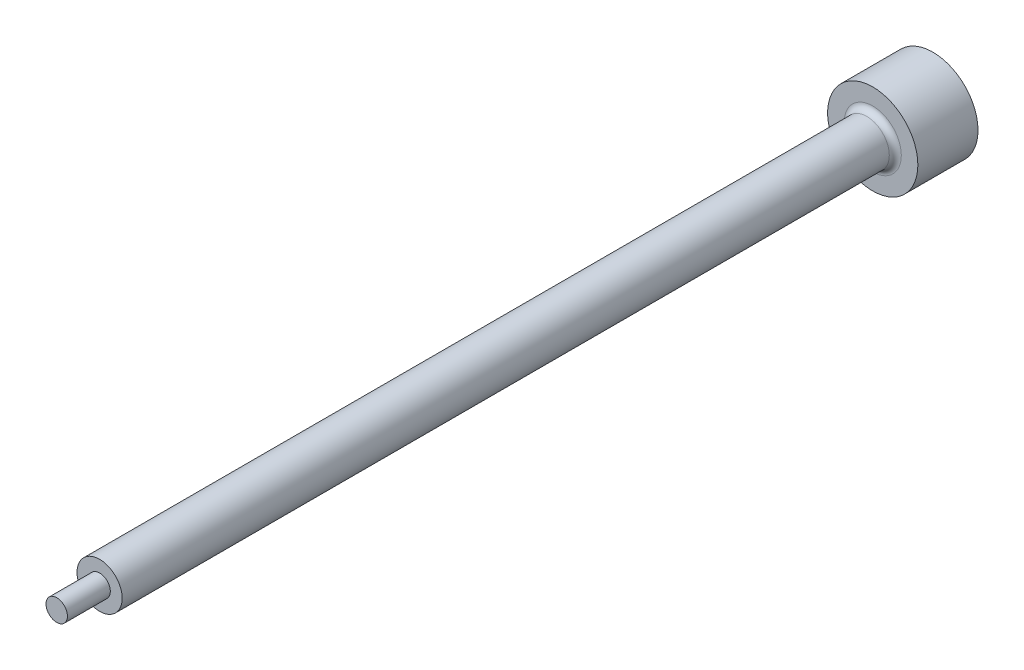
ISO-10303-21;
HEADER;
FILE_DESCRIPTION(('STEP AP214'),'2;1');
FILE_NAME('part.step','',(''),(''),'','','');
FILE_SCHEMA(('AUTOMOTIVE_DESIGN { 1 0 10303 214 1 1 1 1 }'));
ENDSEC;
DATA;
#1=APPLICATION_CONTEXT('core data for automotive mechanical design processes');
#2=APPLICATION_PROTOCOL_DEFINITION('international standard','automotive_design',2000,#1);
#3=PRODUCT_CONTEXT('',#1,'mechanical');
#4=PRODUCT('Part','Part','',(#3));
#5=PRODUCT_RELATED_PRODUCT_CATEGORY('part','',(#4));
#6=PRODUCT_DEFINITION_FORMATION('','',#4);
#7=PRODUCT_DEFINITION_CONTEXT('part definition',#1,'design');
#8=PRODUCT_DEFINITION('design','',#6,#7);
#9=PRODUCT_DEFINITION_SHAPE('','',#8);
#10=(LENGTH_UNIT() NAMED_UNIT(*) SI_UNIT(.MILLI.,.METRE.));
#11=(NAMED_UNIT(*) PLANE_ANGLE_UNIT() SI_UNIT($,.RADIAN.));
#12=(NAMED_UNIT(*) SI_UNIT($,.STERADIAN.) SOLID_ANGLE_UNIT());
#13=UNCERTAINTY_MEASURE_WITH_UNIT(LENGTH_MEASURE(1.E-05),#10,'distance_accuracy_value','');
#14=(GEOMETRIC_REPRESENTATION_CONTEXT(3) GLOBAL_UNCERTAINTY_ASSIGNED_CONTEXT((#13)) GLOBAL_UNIT_ASSIGNED_CONTEXT((#10,
#11,#12)) REPRESENTATION_CONTEXT('',''));
#15=CARTESIAN_POINT('',(0.,0.,0.));
#16=DIRECTION('',(0.,0.,1.));
#17=DIRECTION('',(1.,0.,0.));
#18=AXIS2_PLACEMENT_3D('',#15,#16,#17);
#19=CARTESIAN_POINT('',(0.,0.,2.));
#20=DIRECTION('',(0.,0.,1.));
#21=DIRECTION('',(1.,0.,0.));
#22=AXIS2_PLACEMENT_3D('',#19,#20,#21);
#23=PLANE('',#22);
#24=CARTESIAN_POINT('',(0.,0.,2.));
#25=DIRECTION('',(0.,0.,1.));
#26=DIRECTION('',(1.,0.,0.));
#27=AXIS2_PLACEMENT_3D('',#24,#25,#26);
#28=CIRCLE('',#27,0.95);
#29=CARTESIAN_POINT('',(0.95,0.,2.));
#30=VERTEX_POINT('',#29);
#31=EDGE_CURVE('E11',#30,#30,#28,.F.);
#32=ORIENTED_EDGE('',*,*,#31,.T.);
#33=EDGE_LOOP('',(#32));
#34=FACE_BOUND('',#33,.T.);
#35=CARTESIAN_POINT('',(0.,0.,2.));
#36=DIRECTION('',(0.,0.,1.));
#37=DIRECTION('',(1.,0.,0.));
#38=AXIS2_PLACEMENT_3D('',#35,#36,#37);
#39=CIRCLE('',#38,1.5);
#40=CARTESIAN_POINT('',(1.5,0.,2.));
#41=VERTEX_POINT('',#40);
#42=EDGE_CURVE('E41',#41,#41,#39,.T.);
#43=ORIENTED_EDGE('',*,*,#42,.T.);
#44=EDGE_LOOP('',(#43));
#45=FACE_BOUND('',#44,.T.);
#46=ADVANCED_FACE('F29',(#34,#45),#23,.T.);
#47=CARTESIAN_POINT('',(0.,0.,2.));
#48=DIRECTION('',(0.,0.,-1.));
#49=DIRECTION('',(-1.,0.,0.));
#50=AXIS2_PLACEMENT_3D('',#47,#48,#49);
#51=CYLINDRICAL_SURFACE('',#50,1.5);
#52=ORIENTED_EDGE('',*,*,#42,.F.);
#53=EDGE_LOOP('',(#52));
#54=FACE_BOUND('',#53,.T.);
#55=CARTESIAN_POINT('',(0.,0.,0.));
#56=DIRECTION('',(0.,0.,1.));
#57=DIRECTION('',(1.,0.,0.));
#58=AXIS2_PLACEMENT_3D('',#55,#56,#57);
#59=CIRCLE('',#58,1.5);
#60=CARTESIAN_POINT('',(1.5,0.,0.));
#61=VERTEX_POINT('',#60);
#62=EDGE_CURVE('E46',#61,#61,#59,.T.);
#63=ORIENTED_EDGE('',*,*,#62,.T.);
#64=EDGE_LOOP('',(#63));
#65=FACE_BOUND('',#64,.T.);
#66=ADVANCED_FACE('F31',(#54,#65),#51,.T.);
#67=CARTESIAN_POINT('',(0.,0.,0.));
#68=DIRECTION('',(0.,0.,1.));
#69=DIRECTION('',(1.,0.,0.));
#70=AXIS2_PLACEMENT_3D('',#67,#68,#69);
#71=PLANE('',#70);
#72=ORIENTED_EDGE('',*,*,#62,.F.);
#73=EDGE_LOOP('',(#72));
#74=FACE_BOUND('',#73,.T.);
#75=ADVANCED_FACE('F73',(#74),#71,.F.);
#76=CARTESIAN_POINT('',(0.,0.,202.12132034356));
#77=DIRECTION('',(0.,0.,-1.));
#78=DIRECTION('',(-1.,0.,0.));
#79=AXIS2_PLACEMENT_3D('',#76,#77,#78);
#80=CYLINDRICAL_SURFACE('',#79,0.75);
#81=CARTESIAN_POINT('',(0.,0.,27.70925));
#82=DIRECTION('',(0.,0.,-1.));
#83=DIRECTION('',(-1.,0.,0.));
#84=AXIS2_PLACEMENT_3D('',#81,#82,#83);
#85=CIRCLE('',#84,0.75);
#86=CARTESIAN_POINT('',(-0.75,0.,27.70925));
#87=VERTEX_POINT('',#86);
#88=EDGE_CURVE('E33',#87,#87,#85,.T.);
#89=ORIENTED_EDGE('',*,*,#88,.T.);
#90=EDGE_LOOP('',(#89));
#91=FACE_BOUND('',#90,.T.);
#92=CARTESIAN_POINT('',(0.,0.,2.20000000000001));
#93=DIRECTION('',(0.,0.,1.));
#94=DIRECTION('',(1.,0.,0.));
#95=AXIS2_PLACEMENT_3D('',#92,#93,#94);
#96=CIRCLE('',#95,0.75);
#97=CARTESIAN_POINT('',(0.75,0.,2.20000000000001));
#98=VERTEX_POINT('',#97);
#99=EDGE_CURVE('E37',#98,#98,#96,.T.);
#100=ORIENTED_EDGE('',*,*,#99,.T.);
#101=EDGE_LOOP('',(#100));
#102=FACE_BOUND('',#101,.T.);
#103=ADVANCED_FACE('F79',(#91,#102),#80,.T.);
#104=CARTESIAN_POINT('',(0.,0.,2.20000000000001));
#105=DIRECTION('',(0.,0.,1.));
#106=DIRECTION('',(1.,0.,0.));
#107=AXIS2_PLACEMENT_3D('',#104,#105,#106);
#108=TOROIDAL_SURFACE('',#107,0.95,0.2);
#109=ORIENTED_EDGE('',*,*,#31,.F.);
#110=EDGE_LOOP('',(#109));
#111=FACE_BOUND('',#110,.T.);
#112=ORIENTED_EDGE('',*,*,#99,.F.);
#113=EDGE_LOOP('',(#112));
#114=FACE_BOUND('',#113,.T.);
#115=ADVANCED_FACE('F82',(#111,#114),#108,.F.);
#116=CARTESIAN_POINT('',(0.105580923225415,0.499588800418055,27.70925));
#117=DIRECTION('',(0.,0.,-1.));
#118=DIRECTION('',(0.960603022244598,-0.277924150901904,0.));
#119=AXIS2_PLACEMENT_3D('',#116,#117,#118);
#120=PLANE('',#119);
#121=CARTESIAN_POINT('',(0.,0.,27.70925));
#122=DIRECTION('',(0.,0.,-1.));
#123=DIRECTION('',(0.960603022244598,-0.277924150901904,0.));
#124=AXIS2_PLACEMENT_3D('',#121,#122,#123);
#125=CIRCLE('',#124,0.356475);
#126=CARTESIAN_POINT('',(0.342430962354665,-0.0990730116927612,27.70925));
#127=VERTEX_POINT('',#126);
#128=EDGE_CURVE('E49',#127,#127,#125,.T.);
#129=ORIENTED_EDGE('',*,*,#128,.T.);
#130=EDGE_LOOP('',(#129));
#131=FACE_BOUND('',#130,.T.);
#132=ORIENTED_EDGE('',*,*,#88,.F.);
#133=EDGE_LOOP('',(#132));
#134=FACE_BOUND('',#133,.T.);
#135=ADVANCED_FACE('F64',(#131,#134),#120,.F.);
#136=CARTESIAN_POINT('',(0.,0.,29.13515));
#137=DIRECTION('',(0.,0.,-1.));
#138=DIRECTION('',(0.960603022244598,-0.277924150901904,0.));
#139=AXIS2_PLACEMENT_3D('',#136,#137,#138);
#140=CYLINDRICAL_SURFACE('',#139,0.356475);
#141=ORIENTED_EDGE('',*,*,#128,.F.);
#142=EDGE_LOOP('',(#141));
#143=FACE_BOUND('',#142,.T.);
#144=CARTESIAN_POINT('',(0.,0.,29.13515));
#145=DIRECTION('',(0.,0.,-1.));
#146=DIRECTION('',(0.960603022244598,-0.277924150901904,0.));
#147=AXIS2_PLACEMENT_3D('',#144,#145,#146);
#148=CIRCLE('',#147,0.356475);
#149=CARTESIAN_POINT('',(0.342430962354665,-0.0990730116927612,29.13515));
#150=VERTEX_POINT('',#149);
#151=EDGE_CURVE('E52',#150,#150,#148,.T.);
#152=ORIENTED_EDGE('',*,*,#151,.T.);
#153=EDGE_LOOP('',(#152));
#154=FACE_BOUND('',#153,.T.);
#155=ADVANCED_FACE('F56',(#143,#154),#140,.T.);
#156=CARTESIAN_POINT('',(0.,0.,29.13515));
#157=DIRECTION('',(0.,0.,-1.));
#158=DIRECTION('',(-0.952817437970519,-0.303543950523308,0.));
#159=AXIS2_PLACEMENT_3D('',#156,#157,#158);
#160=PLANE('',#159);
#161=ORIENTED_EDGE('',*,*,#151,.F.);
#162=EDGE_LOOP('',(#161));
#163=FACE_BOUND('',#162,.T.);
#164=ADVANCED_FACE('F58',(#163),#160,.F.);
#165=CLOSED_SHELL('',(#46,#66,#75,#103,#115,#135,#155,#164));
#166=MANIFOLD_SOLID_BREP('B2',#165);
#167=ADVANCED_BREP_SHAPE_REPRESENTATION('',(#18,#166),#14);
#168=SHAPE_DEFINITION_REPRESENTATION(#9,#167);
ENDSEC;
END-ISO-10303-21;
